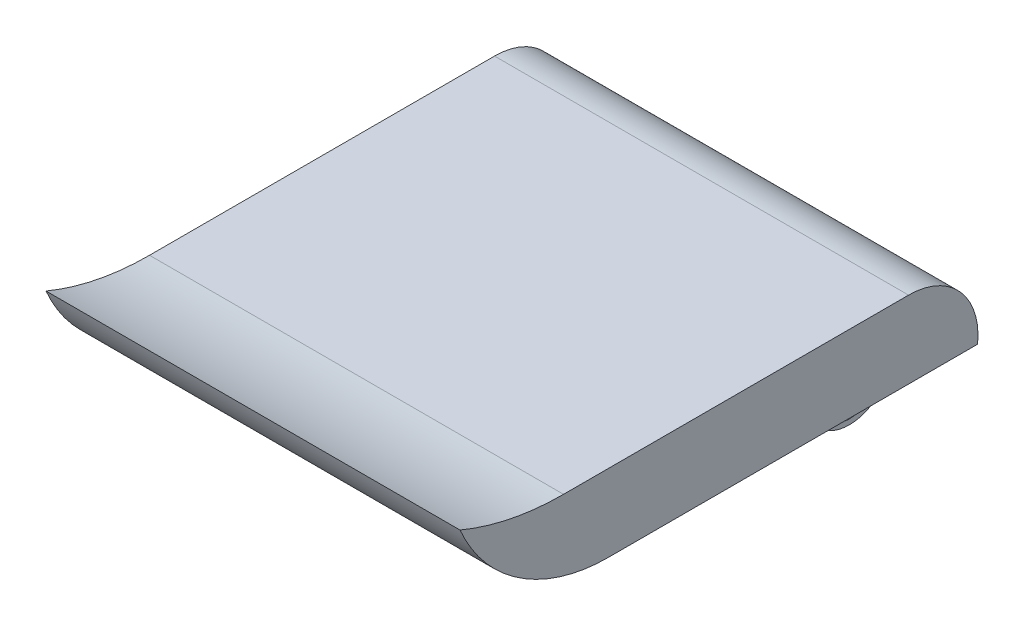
from build123d import *

# Parameters (mm, degrees)
BOSS_EXTRUDE1_DEPTH = 18
SKETCH2_W           = 21
SKETCH2_H           = 7.3
BOSS_EXTRUDE2_DEPTH = 8
CUT_EXTRUDE1_DEPTH  = 40.840049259
SKETCH4_R           = 2
CUT_EXTRUDE2_DEPTH  = 40.840049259


with BuildPart() as part:
    # Sketch1 → Boss-Extrude1 (new, symmetric)
    with BuildSketch(Plane(origin=(0, 0, 0), x_dir=(0, 0, -1), z_dir=(1, 0, 0))):
        with BuildLine():
            Line((-13.605837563, 0), (18.494162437, 0))
            ThreePointArc((18.494162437, 0), (16.991105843, 4.690546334), (12.494162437, 6.7))
            Line((12.494162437, 6.7), (-17.505837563, 6.7))
            ThreePointArc((-17.505837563, 6.7), (-22.095938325, 7.156985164), (-26.505837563, 8.51))
            ThreePointArc((-26.505837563, 8.51), (-21.332902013, 2.319144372), (-13.605837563, 0))
        make_face()
    extrude(amount=BOSS_EXTRUDE1_DEPTH, both=True)

    # Sketch2 → Boss-Extrude2 (add)
    with BuildSketch(Plane.XZ):
        with Locations((0, -14.844162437)):
            Rectangle(SKETCH2_W, SKETCH2_H)
    extrude(amount=BOSS_EXTRUDE2_DEPTH)

    # Sketch3 → Cut-Extrude1 (cut, through all)
    with BuildSketch(Plane.ZY.offset(10.5)):
        with BuildLine():
            Line((-18.494162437, -4.35), (-18.494162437, -8))
            Line((-18.494162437, -8), (-14.844162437, -8))
            ThreePointArc((-14.844162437, -8), (-17.425102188, -6.930939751), (-18.494162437, -4.35))
        make_face()
        with BuildLine():
            ThreePointArc((-11.194162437, -4.35), (-12.263222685, -6.930939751), (-14.844162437, -8))
            Line((-14.844162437, -8), (-11.194162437, -8))
            Line((-11.194162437, -8), (-11.194162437, -4.35))
        make_face()
    extrude(amount=-CUT_EXTRUDE1_DEPTH, mode=Mode.SUBTRACT)

    # Sketch4 → Cut-Extrude2 (cut, through all)
    with BuildSketch(Plane(origin=(10.5, 0, 0), x_dir=(0, 0, -1), z_dir=(1, 0, 0))):
        with Locations((14.844162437, -5.55)):
            Circle(SKETCH4_R)
    extrude(amount=-CUT_EXTRUDE2_DEPTH, mode=Mode.SUBTRACT)


solid = part.part
